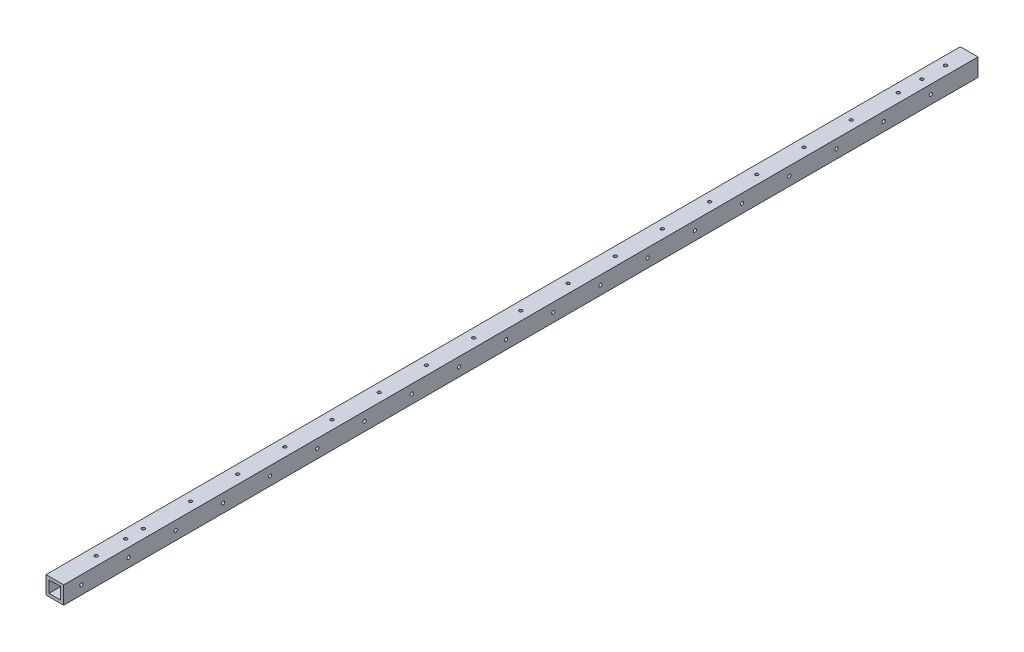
from build123d import *

# Parameters (mm, degrees)
SKETCH1_W             = 19.05
SKETCH1_H             = 19.05
SKETCH1_W_2           = 12.7
SKETCH1_H_2           = 12.7
EXTRUDE1_DEPTH        = 984.25
F_8_32_TAPPED_HOLE1_D = 3.4544
F_8_32_TAPPED_HOLE2_D = 3.4544
LPATTERN3_COUNT       = 19
LPATTERN3_PITCH       = 50.8
LPATTERN4_COUNT       = 19
LPATTERN4_PITCH       = 50.8
F_8_32_TAPPED_HOLE3_D = 3.4544


with BuildPart() as part:
    # Sketch1 → Extrude1 (new body)
    with BuildSketch(Plane.XY):
        Rectangle(SKETCH1_W, SKETCH1_H)
        Rectangle(SKETCH1_W_2, SKETCH1_H_2, mode=Mode.SUBTRACT)
    extrude(amount=EXTRUDE1_DEPTH)

    # 8-32 Tapped Hole1 (through all)
    with Locations(Plane(origin=(0, 9.525, 0), x_dir=(-1, 0, 0), z_dir=(0, 1, 0))):
        with Locations((0, 25.4)):
            f_8_32_tapped_hole1 = Hole(F_8_32_TAPPED_HOLE1_D / 2)

    # 8-32 Tapped Hole2 (through all)
    with Locations(Plane.ZY.offset(9.525)):
        with Locations((50.8, 0)):
            f_8_32_tapped_hole2 = Hole(F_8_32_TAPPED_HOLE2_D / 2)

    # LPattern3: 8-32 Tapped Hole1 ×19
    with Locations(*[(0, 0, i * LPATTERN3_PITCH) for i in range(1, LPATTERN3_COUNT)]):
        add(f_8_32_tapped_hole1, mode=Mode.SUBTRACT)

    # LPattern4: 8-32 Tapped Hole2 ×19
    with Locations(*[(0, 0, i * LPATTERN4_PITCH) for i in range(1, LPATTERN4_COUNT)]):
        add(f_8_32_tapped_hole2, mode=Mode.SUBTRACT)

    # 8-32 Tapped Hole3 (through all)
    with Locations(Plane(origin=(0, 9.525, 0), x_dir=(1, 0, 0), z_dir=(0, 1, 0))):
        with Locations((0, -50.8), (0, -908.05)):
            Hole(F_8_32_TAPPED_HOLE3_D / 2)


solid = part.part
